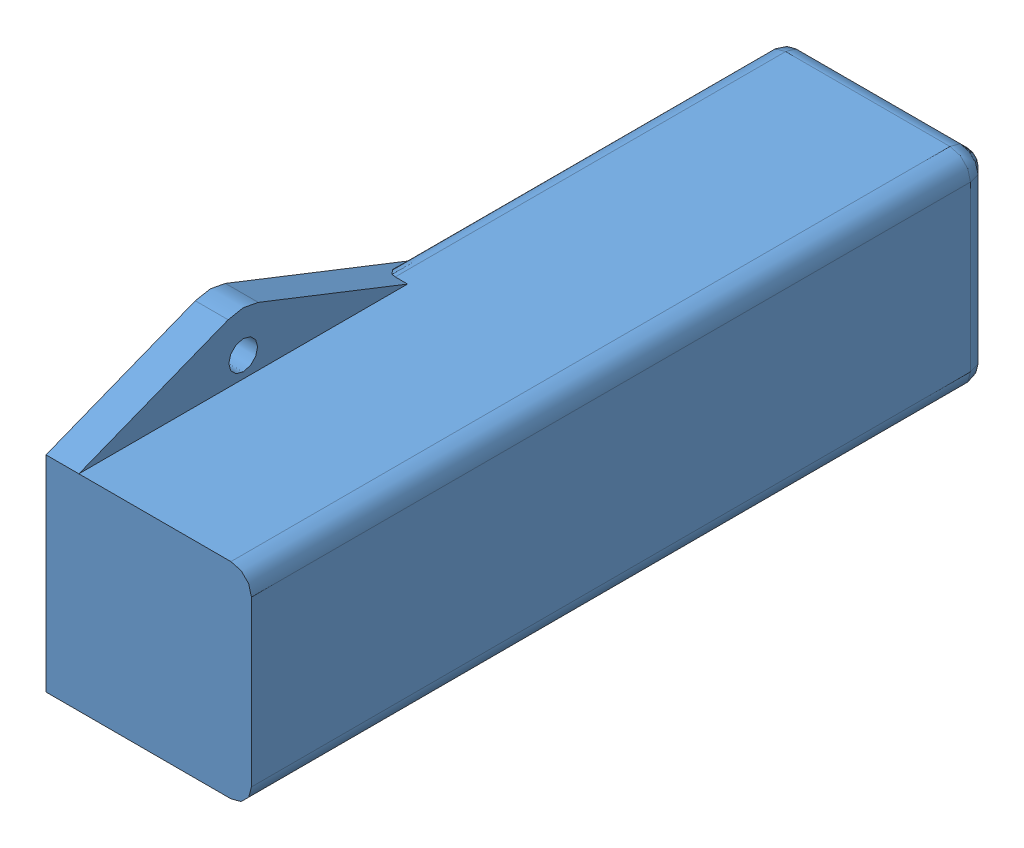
SolidWorks assembly 4403 ENS.SLDASM, configuration Défaut (file format 8000). Lengths in mm.
Overall size (25 40 90).
4 component instances, 4 part files, 9 mates.
Components (placement in the parent):
- 4403-1: 4403.SLDPRT [Défaut] at origin size (25 40 90)
- 4406-1: 4406.SLDPRT [Défaut] at (5 -2.5 25) size (10 10 10)
- 4405-1: 4405.SLDPRT [Défaut] at (5 -2.5 5) size (10 10 10)
- 4404-1: 4404.SLDPRT [Défaut] at (5 -2.5 15) size (10 10 10)
Mates (geometry in assembly coordinates):
- Coïncidente1: coincident aligned: plane of 4406-1; plane of 4404-1
- Coïncidente2: coincident aligned: plane of 4405-1; plane of 4404-1
- Coïncidente3: coincident aligned: plane of 4406-1; plane of 4404-1
- Coïncidente4: coincident aligned: plane of 4405-1; plane of 4404-1
- Coïncidente5: coincident anti-aligned: plane of 4406-1; plane of 4404-1
- Coïncidente6: coincident anti-aligned: plane of 4405-1; plane of 4404-1
- Distance1: distance = 10 mm aligned: plane of 4403-1; plane of 4406-1
- Distance2: distance = 5 mm aligned: plane of 4403-1; plane of 4406-1
- Distance3: distance = 5 mm aligned: plane of 4403-1; plane of 4406-1
